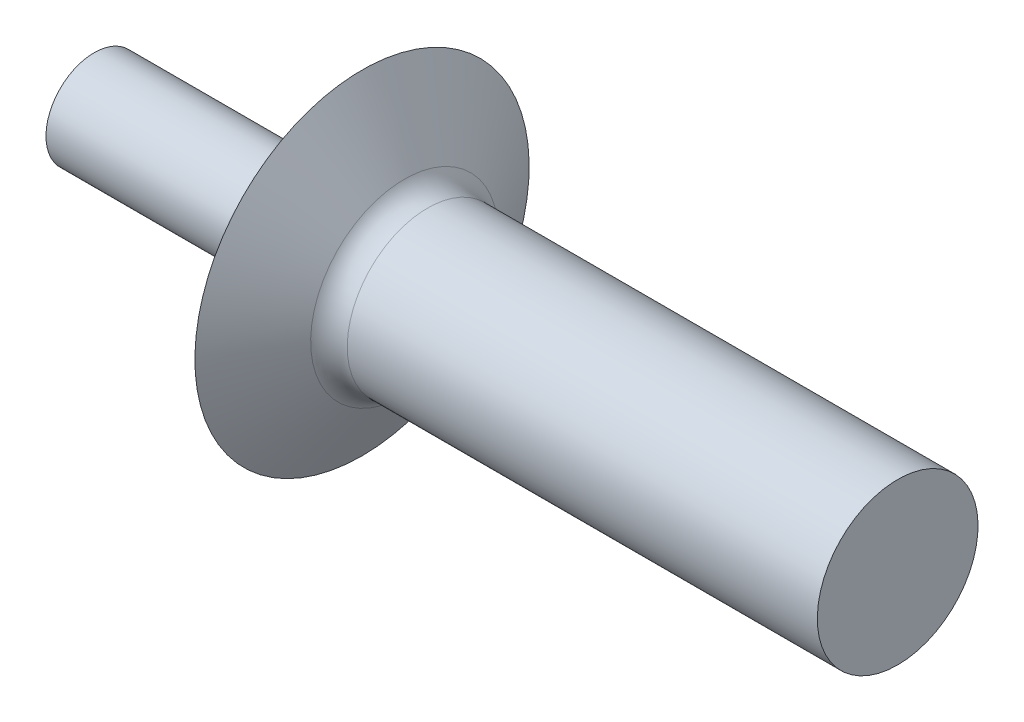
ISO-10303-21;
HEADER;
FILE_DESCRIPTION(('STEP AP214'),'2;1');
FILE_NAME('part.step','',(''),(''),'','','');
FILE_SCHEMA(('AUTOMOTIVE_DESIGN { 1 0 10303 214 1 1 1 1 }'));
ENDSEC;
DATA;
#1=APPLICATION_CONTEXT('core data for automotive mechanical design processes');
#2=APPLICATION_PROTOCOL_DEFINITION('international standard','automotive_design',2000,#1);
#3=PRODUCT_CONTEXT('',#1,'mechanical');
#4=PRODUCT('Part','Part','',(#3));
#5=PRODUCT_RELATED_PRODUCT_CATEGORY('part','',(#4));
#6=PRODUCT_DEFINITION_FORMATION('','',#4);
#7=PRODUCT_DEFINITION_CONTEXT('part definition',#1,'design');
#8=PRODUCT_DEFINITION('design','',#6,#7);
#9=PRODUCT_DEFINITION_SHAPE('','',#8);
#10=(LENGTH_UNIT() NAMED_UNIT(*) SI_UNIT(.MILLI.,.METRE.));
#11=(NAMED_UNIT(*) PLANE_ANGLE_UNIT() SI_UNIT($,.RADIAN.));
#12=(NAMED_UNIT(*) SI_UNIT($,.STERADIAN.) SOLID_ANGLE_UNIT());
#13=UNCERTAINTY_MEASURE_WITH_UNIT(LENGTH_MEASURE(1.E-05),#10,'distance_accuracy_value','');
#14=(GEOMETRIC_REPRESENTATION_CONTEXT(3) GLOBAL_UNCERTAINTY_ASSIGNED_CONTEXT((#13)) GLOBAL_UNIT_ASSIGNED_CONTEXT((#10,
#11,#12)) REPRESENTATION_CONTEXT('',''));
#15=CARTESIAN_POINT('',(0.,0.,0.));
#16=DIRECTION('',(0.,0.,1.));
#17=DIRECTION('',(1.,0.,0.));
#18=AXIS2_PLACEMENT_3D('',#15,#16,#17);
#19=CARTESIAN_POINT('',(15.,0.,0.));
#20=DIRECTION('',(-1.,0.,0.));
#21=DIRECTION('',(0.,-1.,0.));
#22=AXIS2_PLACEMENT_3D('',#19,#20,#21);
#23=PLANE('',#22);
#24=CARTESIAN_POINT('',(15.,0.,0.));
#25=DIRECTION('',(-1.,0.,0.));
#26=DIRECTION('',(0.,-1.,0.));
#27=AXIS2_PLACEMENT_3D('',#24,#25,#26);
#28=CIRCLE('',#27,1.5);
#29=CARTESIAN_POINT('',(15.,-1.5,0.));
#30=VERTEX_POINT('',#29);
#31=EDGE_CURVE('E42',#30,#30,#28,.T.);
#32=ORIENTED_EDGE('',*,*,#31,.F.);
#33=EDGE_LOOP('',(#32));
#34=FACE_BOUND('',#33,.T.);
#35=ADVANCED_FACE('F31',(#34),#23,.F.);
#36=CARTESIAN_POINT('',(-27.2542022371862,0.,0.));
#37=DIRECTION('',(-1.,0.,0.));
#38=DIRECTION('',(0.,-1.,0.));
#39=AXIS2_PLACEMENT_3D('',#36,#37,#38);
#40=CYLINDRICAL_SURFACE('',#39,1.5);
#41=CARTESIAN_POINT('',(6.22398257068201,0.,0.));
#42=DIRECTION('',(-1.,0.,0.));
#43=DIRECTION('',(0.,-1.,0.));
#44=AXIS2_PLACEMENT_3D('',#41,#42,#43);
#45=CIRCLE('',#44,1.5);
#46=CARTESIAN_POINT('',(6.22398257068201,-1.5,0.));
#47=VERTEX_POINT('',#46);
#48=EDGE_CURVE('E10',#47,#47,#45,.F.);
#49=ORIENTED_EDGE('',*,*,#48,.T.);
#50=EDGE_LOOP('',(#49));
#51=FACE_BOUND('',#50,.T.);
#52=ORIENTED_EDGE('',*,*,#31,.T.);
#53=EDGE_LOOP('',(#52));
#54=FACE_BOUND('',#53,.T.);
#55=ADVANCED_FACE('F74',(#51,#54),#40,.T.);
#56=CARTESIAN_POINT('',(5.9353074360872,0.,0.));
#57=DIRECTION('',(-1.,0.,0.));
#58=DIRECTION('',(0.,-1.,0.));
#59=AXIS2_PLACEMENT_3D('',#56,#57,#58);
#60=CONICAL_SURFACE('',#59,1.5,1.04719755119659);
#61=CARTESIAN_POINT('',(5.79096986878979,0.,0.));
#62=DIRECTION('',(-1.,0.,0.));
#63=DIRECTION('',(0.,-1.,0.));
#64=AXIS2_PLACEMENT_3D('',#61,#62,#63);
#65=CIRCLE('',#64,1.75);
#66=CARTESIAN_POINT('',(5.79096986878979,-1.75,0.));
#67=VERTEX_POINT('',#66);
#68=EDGE_CURVE('E38',#67,#67,#65,.T.);
#69=ORIENTED_EDGE('',*,*,#68,.T.);
#70=EDGE_LOOP('',(#69));
#71=FACE_BOUND('',#70,.T.);
#72=CARTESIAN_POINT('',(5.,0.,0.));
#73=DIRECTION('',(-1.,0.,0.));
#74=DIRECTION('',(0.,-1.,0.));
#75=AXIS2_PLACEMENT_3D('',#72,#73,#74);
#76=CIRCLE('',#75,3.12);
#77=CARTESIAN_POINT('',(5.,-3.12,0.));
#78=VERTEX_POINT('',#77);
#79=EDGE_CURVE('E46',#78,#78,#76,.T.);
#80=ORIENTED_EDGE('',*,*,#79,.F.);
#81=EDGE_LOOP('',(#80));
#82=FACE_BOUND('',#81,.T.);
#83=ADVANCED_FACE('F69',(#71,#82),#60,.T.);
#84=CARTESIAN_POINT('',(5.,3.12,0.));
#85=DIRECTION('',(1.,0.,0.));
#86=DIRECTION('',(0.,1.,0.));
#87=AXIS2_PLACEMENT_3D('',#84,#85,#86);
#88=PLANE('',#87);
#89=CARTESIAN_POINT('',(5.,0.,0.));
#90=DIRECTION('',(-1.,0.,0.));
#91=DIRECTION('',(0.,-1.,0.));
#92=AXIS2_PLACEMENT_3D('',#89,#90,#91);
#93=CIRCLE('',#92,0.900000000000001);
#94=CARTESIAN_POINT('',(5.,-0.900000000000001,0.));
#95=VERTEX_POINT('',#94);
#96=EDGE_CURVE('E51',#95,#95,#93,.T.);
#97=ORIENTED_EDGE('',*,*,#96,.F.);
#98=EDGE_LOOP('',(#97));
#99=FACE_BOUND('',#98,.T.);
#100=ORIENTED_EDGE('',*,*,#79,.T.);
#101=EDGE_LOOP('',(#100));
#102=FACE_BOUND('',#101,.T.);
#103=ADVANCED_FACE('F63',(#99,#102),#88,.F.);
#104=CARTESIAN_POINT('',(-27.2542022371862,0.,0.));
#105=DIRECTION('',(-1.,0.,0.));
#106=DIRECTION('',(0.,-1.,0.));
#107=AXIS2_PLACEMENT_3D('',#104,#105,#106);
#108=CYLINDRICAL_SURFACE('',#107,0.900000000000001);
#109=CARTESIAN_POINT('',(0.,0.,0.));
#110=DIRECTION('',(-1.,0.,0.));
#111=DIRECTION('',(0.,-1.,0.));
#112=AXIS2_PLACEMENT_3D('',#109,#110,#111);
#113=CIRCLE('',#112,0.900000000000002);
#114=CARTESIAN_POINT('',(0.,-0.900000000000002,0.));
#115=VERTEX_POINT('',#114);
#116=EDGE_CURVE('E54',#115,#115,#113,.T.);
#117=ORIENTED_EDGE('',*,*,#116,.F.);
#118=EDGE_LOOP('',(#117));
#119=FACE_BOUND('',#118,.T.);
#120=ORIENTED_EDGE('',*,*,#96,.T.);
#121=EDGE_LOOP('',(#120));
#122=FACE_BOUND('',#121,.T.);
#123=ADVANCED_FACE('F60',(#119,#122),#108,.T.);
#124=CARTESIAN_POINT('',(0.,0.900000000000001,0.));
#125=DIRECTION('',(1.,0.,0.));
#126=DIRECTION('',(0.,1.,0.));
#127=AXIS2_PLACEMENT_3D('',#124,#125,#126);
#128=PLANE('',#127);
#129=ORIENTED_EDGE('',*,*,#116,.T.);
#130=EDGE_LOOP('',(#129));
#131=FACE_BOUND('',#130,.T.);
#132=ADVANCED_FACE('F58',(#131),#128,.F.);
#133=CARTESIAN_POINT('',(6.22398257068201,0.,0.));
#134=DIRECTION('',(-1.,0.,0.));
#135=DIRECTION('',(0.,-1.,0.));
#136=AXIS2_PLACEMENT_3D('',#133,#134,#135);
#137=TOROIDAL_SURFACE('',#136,2.,0.5);
#138=ORIENTED_EDGE('',*,*,#48,.F.);
#139=EDGE_LOOP('',(#138));
#140=FACE_BOUND('',#139,.T.);
#141=ORIENTED_EDGE('',*,*,#68,.F.);
#142=EDGE_LOOP('',(#141));
#143=FACE_BOUND('',#142,.T.);
#144=ADVANCED_FACE('F33',(#140,#143),#137,.F.);
#145=CLOSED_SHELL('',(#35,#55,#83,#103,#123,#132,#144));
#146=MANIFOLD_SOLID_BREP('B2',#145);
#147=ADVANCED_BREP_SHAPE_REPRESENTATION('',(#18,#146),#14);
#148=SHAPE_DEFINITION_REPRESENTATION(#9,#147);
ENDSEC;
END-ISO-10303-21;
